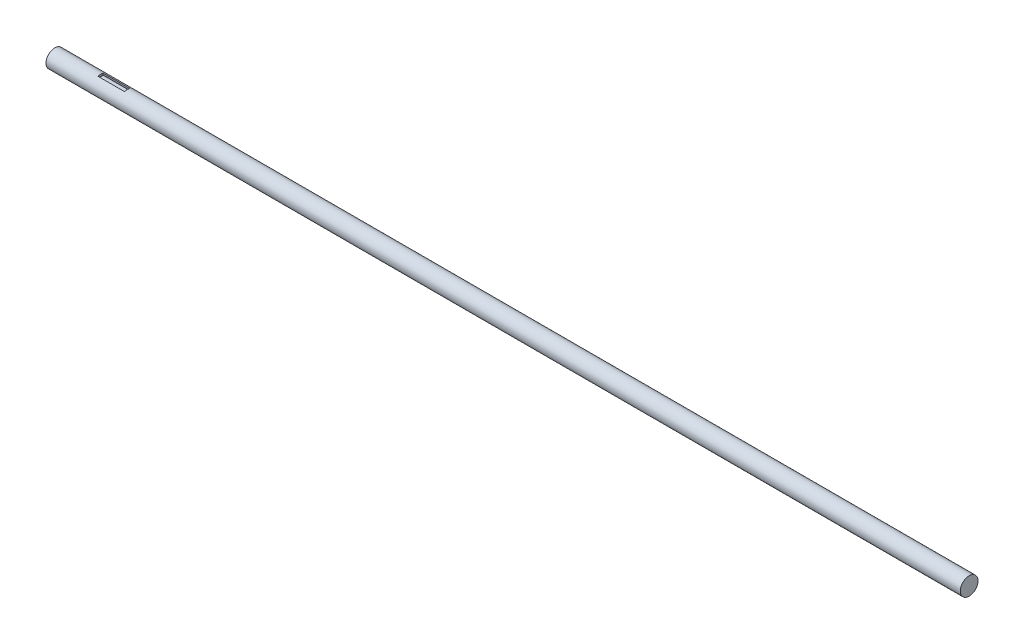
ISO-10303-21;
HEADER;
FILE_DESCRIPTION(('STEP AP214'),'2;1');
FILE_NAME('part.step','',(''),(''),'','','');
FILE_SCHEMA(('AUTOMOTIVE_DESIGN { 1 0 10303 214 1 1 1 1 }'));
ENDSEC;
DATA;
#1=APPLICATION_CONTEXT('core data for automotive mechanical design processes');
#2=APPLICATION_PROTOCOL_DEFINITION('international standard','automotive_design',2000,#1);
#3=PRODUCT_CONTEXT('',#1,'mechanical');
#4=PRODUCT('Part','Part','',(#3));
#5=PRODUCT_RELATED_PRODUCT_CATEGORY('part','',(#4));
#6=PRODUCT_DEFINITION_FORMATION('','',#4);
#7=PRODUCT_DEFINITION_CONTEXT('part definition',#1,'design');
#8=PRODUCT_DEFINITION('design','',#6,#7);
#9=PRODUCT_DEFINITION_SHAPE('','',#8);
#10=(LENGTH_UNIT() NAMED_UNIT(*) SI_UNIT(.MILLI.,.METRE.));
#11=(NAMED_UNIT(*) PLANE_ANGLE_UNIT() SI_UNIT($,.RADIAN.));
#12=(NAMED_UNIT(*) SI_UNIT($,.STERADIAN.) SOLID_ANGLE_UNIT());
#13=UNCERTAINTY_MEASURE_WITH_UNIT(LENGTH_MEASURE(1.E-05),#10,'distance_accuracy_value','');
#14=(GEOMETRIC_REPRESENTATION_CONTEXT(3) GLOBAL_UNCERTAINTY_ASSIGNED_CONTEXT((#13)) GLOBAL_UNIT_ASSIGNED_CONTEXT((#10,
#11,#12)) REPRESENTATION_CONTEXT('',''));
#15=CARTESIAN_POINT('',(0.,0.,0.));
#16=DIRECTION('',(0.,0.,1.));
#17=DIRECTION('',(1.,0.,0.));
#18=AXIS2_PLACEMENT_3D('',#15,#16,#17);
#19=CARTESIAN_POINT('',(3100.,0.,0.));
#20=DIRECTION('',(-1.,0.,0.));
#21=DIRECTION('',(0.,0.,1.));
#22=AXIS2_PLACEMENT_3D('',#19,#20,#21);
#23=CYLINDRICAL_SURFACE('',#22,30.);
#24=CARTESIAN_POINT('',(3100.,0.,0.));
#25=DIRECTION('',(1.,0.,0.));
#26=DIRECTION('',(0.,0.,-1.));
#27=AXIS2_PLACEMENT_3D('',#24,#25,#26);
#28=CIRCLE('',#27,30.);
#29=CARTESIAN_POINT('',(3100.,0.,-30.));
#30=VERTEX_POINT('',#29);
#31=EDGE_CURVE('E107',#30,#30,#28,.T.);
#32=ORIENTED_EDGE('',*,*,#31,.F.);
#33=EDGE_LOOP('',(#32));
#34=FACE_BOUND('',#33,.T.);
#35=CARTESIAN_POINT('',(0.,0.,0.));
#36=DIRECTION('',(1.,0.,0.));
#37=DIRECTION('',(0.,0.,-1.));
#38=AXIS2_PLACEMENT_3D('',#35,#36,#37);
#39=CIRCLE('',#38,30.);
#40=CARTESIAN_POINT('',(0.,0.,-30.));
#41=VERTEX_POINT('',#40);
#42=EDGE_CURVE('E111',#41,#41,#39,.T.);
#43=ORIENTED_EDGE('',*,*,#42,.T.);
#44=EDGE_LOOP('',(#43));
#45=FACE_BOUND('',#44,.T.);
#46=CARTESIAN_POINT('',(245.,0.,0.));
#47=DIRECTION('',(-1.,0.,0.));
#48=DIRECTION('',(0.,0.,1.));
#49=AXIS2_PLACEMENT_3D('',#46,#47,#48);
#50=CIRCLE('',#49,30.);
#51=CARTESIAN_POINT('',(245.,28.6181760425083,9.00000000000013));
#52=VERTEX_POINT('',#51);
#53=CARTESIAN_POINT('',(245.,28.6181760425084,-8.99999999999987));
#54=VERTEX_POINT('',#53);
#55=EDGE_CURVE('E104',#52,#54,#50,.T.);
#56=ORIENTED_EDGE('',*,*,#55,.F.);
#57=DIRECTION('',(-1.,0.,0.));
#58=VECTOR('',#57,1.);
#59=CARTESIAN_POINT('',(3100.,28.6181760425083,9.00000000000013));
#60=LINE('',#59,#58);
#61=CARTESIAN_POINT('',(155.,28.6181760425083,9.00000000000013));
#62=VERTEX_POINT('',#61);
#63=EDGE_CURVE('E103',#52,#62,#60,.T.);
#64=ORIENTED_EDGE('',*,*,#63,.T.);
#65=CARTESIAN_POINT('',(155.,0.,0.));
#66=DIRECTION('',(-1.,0.,0.));
#67=DIRECTION('',(0.,0.,1.));
#68=AXIS2_PLACEMENT_3D('',#65,#66,#67);
#69=CIRCLE('',#68,30.);
#70=CARTESIAN_POINT('',(155.,28.6181760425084,-8.99999999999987));
#71=VERTEX_POINT('',#70);
#72=EDGE_CURVE('E92',#62,#71,#69,.T.);
#73=ORIENTED_EDGE('',*,*,#72,.T.);
#74=DIRECTION('',(-1.,0.,0.));
#75=VECTOR('',#74,1.);
#76=CARTESIAN_POINT('',(3100.,28.6181760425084,-8.99999999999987));
#77=LINE('',#76,#75);
#78=EDGE_CURVE('E98',#54,#71,#77,.T.);
#79=ORIENTED_EDGE('',*,*,#78,.F.);
#80=EDGE_LOOP('',(#56,#64,#73,#79));
#81=FACE_BOUND('',#80,.T.);
#82=ADVANCED_FACE('F37',(#34,#45,#81),#23,.T.);
#83=CARTESIAN_POINT('',(3100.,0.,0.));
#84=DIRECTION('',(1.,0.,0.));
#85=DIRECTION('',(0.,0.,-1.));
#86=AXIS2_PLACEMENT_3D('',#83,#84,#85);
#87=PLANE('',#86);
#88=ORIENTED_EDGE('',*,*,#31,.T.);
#89=EDGE_LOOP('',(#88));
#90=FACE_BOUND('',#89,.T.);
#91=ADVANCED_FACE('F157',(#90),#87,.T.);
#92=CARTESIAN_POINT('',(0.,0.,0.));
#93=DIRECTION('',(1.,0.,0.));
#94=DIRECTION('',(0.,0.,-1.));
#95=AXIS2_PLACEMENT_3D('',#92,#93,#94);
#96=PLANE('',#95);
#97=ORIENTED_EDGE('',*,*,#42,.F.);
#98=EDGE_LOOP('',(#97));
#99=FACE_BOUND('',#98,.T.);
#100=ADVANCED_FACE('F154',(#99),#96,.F.);
#101=CARTESIAN_POINT('',(245.,23.,0.));
#102=DIRECTION('',(-1.,0.,0.));
#103=DIRECTION('',(0.,0.,1.));
#104=AXIS2_PLACEMENT_3D('',#101,#102,#103);
#105=PLANE('',#104);
#106=DIRECTION('',(0.,1.,0.));
#107=VECTOR('',#106,1.);
#108=CARTESIAN_POINT('',(245.,23.,-8.99999999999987));
#109=LINE('',#108,#107);
#110=CARTESIAN_POINT('',(245.,23.6,-8.99999999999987));
#111=VERTEX_POINT('',#110);
#112=EDGE_CURVE('E95',#111,#54,#109,.T.);
#113=ORIENTED_EDGE('',*,*,#112,.F.);
#114=DIRECTION('',(0.,0.,1.));
#115=VECTOR('',#114,1.);
#116=CARTESIAN_POINT('',(245.,23.6,9.00000000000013));
#117=LINE('',#116,#115);
#118=CARTESIAN_POINT('',(245.,23.6,9.00000000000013));
#119=VERTEX_POINT('',#118);
#120=EDGE_CURVE('E128',#111,#119,#117,.T.);
#121=ORIENTED_EDGE('',*,*,#120,.T.);
#122=DIRECTION('',(0.,1.,0.));
#123=VECTOR('',#122,1.);
#124=CARTESIAN_POINT('',(245.,23.,9.00000000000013));
#125=LINE('',#124,#123);
#126=EDGE_CURVE('E147',#119,#52,#125,.T.);
#127=ORIENTED_EDGE('',*,*,#126,.T.);
#128=ORIENTED_EDGE('',*,*,#55,.T.);
#129=EDGE_LOOP('',(#113,#121,#127,#128));
#130=FACE_BOUND('',#129,.T.);
#131=ADVANCED_FACE('F156',(#130),#105,.T.);
#132=CARTESIAN_POINT('',(0.,23.,9.00000000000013));
#133=DIRECTION('',(0.,0.,1.));
#134=DIRECTION('',(1.,0.,0.));
#135=AXIS2_PLACEMENT_3D('',#132,#133,#134);
#136=PLANE('',#135);
#137=ORIENTED_EDGE('',*,*,#126,.F.);
#138=DIRECTION('',(1.,0.,0.));
#139=VECTOR('',#138,1.);
#140=CARTESIAN_POINT('',(0.,23.6,9.00000000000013));
#141=LINE('',#140,#139);
#142=CARTESIAN_POINT('',(155.,23.6,9.00000000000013));
#143=VERTEX_POINT('',#142);
#144=EDGE_CURVE('E125',#119,#143,#141,.F.);
#145=ORIENTED_EDGE('',*,*,#144,.T.);
#146=DIRECTION('',(0.,1.,0.));
#147=VECTOR('',#146,1.);
#148=CARTESIAN_POINT('',(155.,23.,9.00000000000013));
#149=LINE('',#148,#147);
#150=EDGE_CURVE('E94',#143,#62,#149,.T.);
#151=ORIENTED_EDGE('',*,*,#150,.T.);
#152=ORIENTED_EDGE('',*,*,#63,.F.);
#153=EDGE_LOOP('',(#137,#145,#151,#152));
#154=FACE_BOUND('',#153,.T.);
#155=ADVANCED_FACE('F164',(#154),#136,.F.);
#156=CARTESIAN_POINT('',(155.,23.,0.));
#157=DIRECTION('',(-1.,0.,0.));
#158=DIRECTION('',(0.,0.,1.));
#159=AXIS2_PLACEMENT_3D('',#156,#157,#158);
#160=PLANE('',#159);
#161=ORIENTED_EDGE('',*,*,#150,.F.);
#162=DIRECTION('',(0.,0.,1.));
#163=VECTOR('',#162,1.);
#164=CARTESIAN_POINT('',(155.,23.6,0.));
#165=LINE('',#164,#163);
#166=CARTESIAN_POINT('',(155.,23.6,-8.99999999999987));
#167=VERTEX_POINT('',#166);
#168=EDGE_CURVE('E46',#143,#167,#165,.F.);
#169=ORIENTED_EDGE('',*,*,#168,.T.);
#170=DIRECTION('',(0.,1.,0.));
#171=VECTOR('',#170,1.);
#172=CARTESIAN_POINT('',(155.,23.,-8.99999999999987));
#173=LINE('',#172,#171);
#174=EDGE_CURVE('E88',#167,#71,#173,.T.);
#175=ORIENTED_EDGE('',*,*,#174,.T.);
#176=ORIENTED_EDGE('',*,*,#72,.F.);
#177=EDGE_LOOP('',(#161,#169,#175,#176));
#178=FACE_BOUND('',#177,.T.);
#179=ADVANCED_FACE('F90',(#178),#160,.F.);
#180=CARTESIAN_POINT('',(0.,23.,-8.99999999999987));
#181=DIRECTION('',(0.,0.,1.));
#182=DIRECTION('',(1.,0.,0.));
#183=AXIS2_PLACEMENT_3D('',#180,#181,#182);
#184=PLANE('',#183);
#185=ORIENTED_EDGE('',*,*,#174,.F.);
#186=DIRECTION('',(1.,0.,0.));
#187=VECTOR('',#186,1.);
#188=CARTESIAN_POINT('',(245.,23.6,-8.99999999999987));
#189=LINE('',#188,#187);
#190=EDGE_CURVE('E11',#167,#111,#189,.T.);
#191=ORIENTED_EDGE('',*,*,#190,.T.);
#192=ORIENTED_EDGE('',*,*,#112,.T.);
#193=ORIENTED_EDGE('',*,*,#78,.T.);
#194=EDGE_LOOP('',(#185,#191,#192,#193));
#195=FACE_BOUND('',#194,.T.);
#196=ADVANCED_FACE('F99',(#195),#184,.T.);
#197=CARTESIAN_POINT('',(0.,23.,0.));
#198=DIRECTION('',(0.,1.,0.));
#199=DIRECTION('',(0.,0.,1.));
#200=AXIS2_PLACEMENT_3D('',#197,#198,#199);
#201=PLANE('',#200);
#202=DIRECTION('',(0.,0.,1.));
#203=VECTOR('',#202,1.);
#204=CARTESIAN_POINT('',(155.6,23.,0.));
#205=LINE('',#204,#203);
#206=CARTESIAN_POINT('',(155.6,23.,-8.39999999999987));
#207=VERTEX_POINT('',#206);
#208=CARTESIAN_POINT('',(155.6,23.,8.40000000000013));
#209=VERTEX_POINT('',#208);
#210=EDGE_CURVE('E118',#207,#209,#205,.T.);
#211=ORIENTED_EDGE('',*,*,#210,.T.);
#212=DIRECTION('',(1.,0.,0.));
#213=VECTOR('',#212,1.);
#214=CARTESIAN_POINT('',(0.,23.,8.40000000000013));
#215=LINE('',#214,#213);
#216=CARTESIAN_POINT('',(244.4,23.,8.40000000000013));
#217=VERTEX_POINT('',#216);
#218=EDGE_CURVE('E122',#209,#217,#215,.T.);
#219=ORIENTED_EDGE('',*,*,#218,.T.);
#220=DIRECTION('',(0.,0.,1.));
#221=VECTOR('',#220,1.);
#222=CARTESIAN_POINT('',(244.4,23.,-8.99999999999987));
#223=LINE('',#222,#221);
#224=CARTESIAN_POINT('',(244.4,23.,-8.39999999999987));
#225=VERTEX_POINT('',#224);
#226=EDGE_CURVE('E120',#217,#225,#223,.F.);
#227=ORIENTED_EDGE('',*,*,#226,.T.);
#228=DIRECTION('',(1.,0.,0.));
#229=VECTOR('',#228,1.);
#230=CARTESIAN_POINT('',(155.,23.,-8.39999999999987));
#231=LINE('',#230,#229);
#232=EDGE_CURVE('E116',#225,#207,#231,.F.);
#233=ORIENTED_EDGE('',*,*,#232,.T.);
#234=EDGE_LOOP('',(#211,#219,#227,#233));
#235=FACE_BOUND('',#234,.T.);
#236=ADVANCED_FACE('F186',(#235),#201,.T.);
#237=CARTESIAN_POINT('',(0.,23.6,-8.39999999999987));
#238=DIRECTION('',(-1.,0.,0.));
#239=DIRECTION('',(0.,0.,1.));
#240=AXIS2_PLACEMENT_3D('',#237,#238,#239);
#241=CYLINDRICAL_SURFACE('',#240,0.6);
#242=CARTESIAN_POINT('',(244.4,23.6,-8.39999999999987));
#243=DIRECTION('',(-0.707106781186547,0.,-0.707106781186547));
#244=DIRECTION('',(0.707106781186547,0.,-0.707106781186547));
#245=AXIS2_PLACEMENT_3D('',#242,#243,#244);
#246=ELLIPSE('',#245,0.848528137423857,0.6);
#247=EDGE_CURVE('E134',#111,#225,#246,.T.);
#248=ORIENTED_EDGE('',*,*,#247,.F.);
#249=ORIENTED_EDGE('',*,*,#190,.F.);
#250=CARTESIAN_POINT('',(155.6,23.6,-8.39999999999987));
#251=DIRECTION('',(-0.707106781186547,0.,0.707106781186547));
#252=DIRECTION('',(0.707106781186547,0.,0.707106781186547));
#253=AXIS2_PLACEMENT_3D('',#250,#251,#252);
#254=ELLIPSE('',#253,0.848528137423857,0.6);
#255=EDGE_CURVE('E41',#207,#167,#254,.F.);
#256=ORIENTED_EDGE('',*,*,#255,.F.);
#257=ORIENTED_EDGE('',*,*,#232,.F.);
#258=EDGE_LOOP('',(#248,#249,#256,#257));
#259=FACE_BOUND('',#258,.T.);
#260=ADVANCED_FACE('F39',(#259),#241,.F.);
#261=CARTESIAN_POINT('',(155.6,23.6,0.));
#262=DIRECTION('',(0.,0.,1.));
#263=DIRECTION('',(1.,0.,0.));
#264=AXIS2_PLACEMENT_3D('',#261,#262,#263);
#265=CYLINDRICAL_SURFACE('',#264,0.6);
#266=ORIENTED_EDGE('',*,*,#255,.T.);
#267=ORIENTED_EDGE('',*,*,#168,.F.);
#268=CARTESIAN_POINT('',(155.6,23.6,8.40000000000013));
#269=DIRECTION('',(0.707106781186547,0.,0.707106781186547));
#270=DIRECTION('',(0.707106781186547,0.,-0.707106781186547));
#271=AXIS2_PLACEMENT_3D('',#268,#269,#270);
#272=ELLIPSE('',#271,0.848528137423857,0.6);
#273=EDGE_CURVE('E133',#209,#143,#272,.F.);
#274=ORIENTED_EDGE('',*,*,#273,.F.);
#275=ORIENTED_EDGE('',*,*,#210,.F.);
#276=EDGE_LOOP('',(#266,#267,#274,#275));
#277=FACE_BOUND('',#276,.T.);
#278=ADVANCED_FACE('F181',(#277),#265,.F.);
#279=CARTESIAN_POINT('',(244.4,23.6,0.));
#280=DIRECTION('',(0.,0.,-1.));
#281=DIRECTION('',(-1.,0.,0.));
#282=AXIS2_PLACEMENT_3D('',#279,#280,#281);
#283=CYLINDRICAL_SURFACE('',#282,0.6);
#284=ORIENTED_EDGE('',*,*,#247,.T.);
#285=ORIENTED_EDGE('',*,*,#226,.F.);
#286=CARTESIAN_POINT('',(244.4,23.6,8.40000000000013));
#287=DIRECTION('',(0.707106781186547,0.,-0.707106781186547));
#288=DIRECTION('',(0.707106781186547,0.,0.707106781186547));
#289=AXIS2_PLACEMENT_3D('',#286,#287,#288);
#290=ELLIPSE('',#289,0.848528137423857,0.6);
#291=EDGE_CURVE('E131',#119,#217,#290,.T.);
#292=ORIENTED_EDGE('',*,*,#291,.F.);
#293=ORIENTED_EDGE('',*,*,#120,.F.);
#294=EDGE_LOOP('',(#284,#285,#292,#293));
#295=FACE_BOUND('',#294,.T.);
#296=ADVANCED_FACE('F178',(#295),#283,.F.);
#297=CARTESIAN_POINT('',(0.,23.6,8.40000000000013));
#298=DIRECTION('',(1.,0.,0.));
#299=DIRECTION('',(0.,0.,-1.));
#300=AXIS2_PLACEMENT_3D('',#297,#298,#299);
#301=CYLINDRICAL_SURFACE('',#300,0.6);
#302=ORIENTED_EDGE('',*,*,#273,.T.);
#303=ORIENTED_EDGE('',*,*,#144,.F.);
#304=ORIENTED_EDGE('',*,*,#291,.T.);
#305=ORIENTED_EDGE('',*,*,#218,.F.);
#306=EDGE_LOOP('',(#302,#303,#304,#305));
#307=FACE_BOUND('',#306,.T.);
#308=ADVANCED_FACE('F175',(#307),#301,.F.);
#309=CLOSED_SHELL('',(#82,#91,#100,#131,#155,#179,#196,#236,#260,#278,#296,#308));
#310=MANIFOLD_SOLID_BREP('B2',#309);
#311=ADVANCED_BREP_SHAPE_REPRESENTATION('',(#18,#310),#14);
#312=SHAPE_DEFINITION_REPRESENTATION(#9,#311);
ENDSEC;
END-ISO-10303-21;
